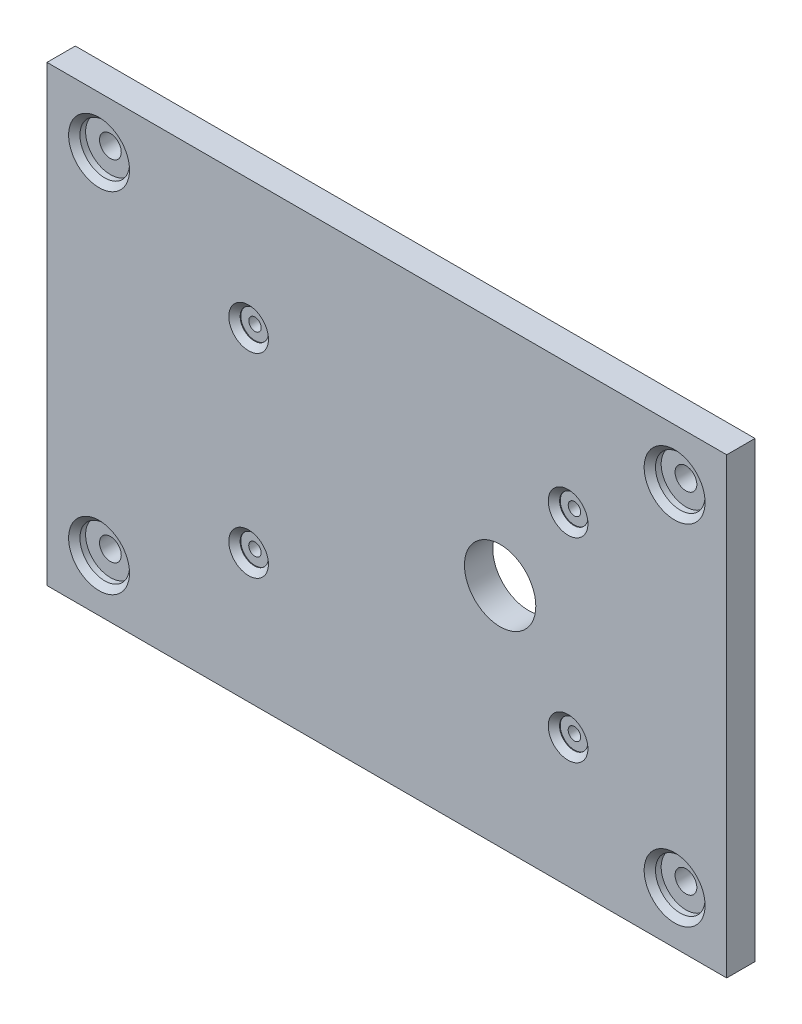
from build123d import *

# Parameters (mm, degrees)
SKETCH1_W                                   = 76.2
SKETCH1_H                                   = 50.8
BOSS_EXTRUDE1_DEPTH                         = 3.175
CBORE_FOR_2_BINDING_HEAD_MACHINE_SC_2_COUNT = 2
CBORE_FOR_2_BINDING_HEAD_MACHINE_SC_2_PITCH = 75.461112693
CBORE_FOR_2_BINDING_HEAD_MACHINE_SC_3_COUNT = 2
CBORE_FOR_2_BINDING_HEAD_MACHINE_SC_3_PITCH = 39.125667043
CBORE_FOR_2_BINDING_HEAD_MACHINE_SC_4_COUNT = 2
CBORE_FOR_2_BINDING_HEAD_MACHINE_SC_4_PITCH = 64.525667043
SKETCH4_R                                   = 4.0005
CUT_EXTRUDE1_DEPTH                          = 92.636022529
CBORE_FOR_00_BINDING_HEAD_MACHINE_S_2_COUNT = 2
CBORE_FOR_00_BINDING_HEAD_MACHINE_S_2_PITCH = 41.949235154
CBORE_FOR_00_BINDING_HEAD_MACHINE_S_3_COUNT = 2
CBORE_FOR_00_BINDING_HEAD_MACHINE_S_3_PITCH = 35.814618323
CBORE_FOR_00_BINDING_HEAD_MACHINE_S_4_COUNT = 2
CBORE_FOR_00_BINDING_HEAD_MACHINE_S_4_PITCH = 21.844663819


with BuildPart() as part:
    # Sketch1 → Boss-Extrude1 (new body)
    with BuildSketch(Plane.XY):
        with Locations((38.1, 25.4)):
            Rectangle(SKETCH1_W, SKETCH1_H)
    extrude(amount=BOSS_EXTRUDE1_DEPTH)

    # Sketch3 → CBORE for _2 Binding Head Machine Screw1 (revolve, cut)
    with BuildSketch(Plane(origin=(70.362833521, 5.837166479, 3.175), x_dir=(0, -1, 0), z_dir=(1, 0, 0))):
        Polygon((0, 0), (0, 13.432569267), (1.2192, 12.7), (1.2192, 1.27), (2.77876, 1.27), (2.77876, 0.635), (3.41376, 0), align=None)
    cbore_for_2_binding_head_machine_screw1 = revolve(axis=Axis((70.362833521, 5.837166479, 9.525), (0, 0, -1)), mode=Mode.SUBTRACT)

    # CBORE for _2 Binding Head Machine Sc 2: CBORE for _2 Binding Head Machine Screw1 ×2
    with Locations(*[Vector(-0.8550850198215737, 0.5184878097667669, 0) * (i * CBORE_FOR_2_BINDING_HEAD_MACHINE_SC_2_PITCH) for i in range(1, CBORE_FOR_2_BINDING_HEAD_MACHINE_SC_2_COUNT)]):
        add(cbore_for_2_binding_head_machine_screw1, mode=Mode.SUBTRACT)

    # CBORE for _2 Binding Head Machine Sc 3: CBORE for _2 Binding Head Machine Screw1 ×2
    with Locations(*[(0, i * CBORE_FOR_2_BINDING_HEAD_MACHINE_SC_3_PITCH, 0) for i in range(1, CBORE_FOR_2_BINDING_HEAD_MACHINE_SC_3_COUNT)]):
        add(cbore_for_2_binding_head_machine_screw1, mode=Mode.SUBTRACT)

    # CBORE for _2 Binding Head Machine Sc 4: CBORE for _2 Binding Head Machine Screw1 ×2
    with Locations(*[(-i * CBORE_FOR_2_BINDING_HEAD_MACHINE_SC_4_PITCH, 0, 0) for i in range(1, CBORE_FOR_2_BINDING_HEAD_MACHINE_SC_4_COUNT)]):
        add(cbore_for_2_binding_head_machine_screw1, mode=Mode.SUBTRACT)

    # Sketch4 → Cut-Extrude1 (cut, through all)
    with BuildSketch(Plane.XY.offset(3.175)):
        with Locations((50.8, 25.4)):
            Circle(SKETCH4_R)
    extrude(amount=-CUT_EXTRUDE1_DEPTH, mode=Mode.SUBTRACT)

    # Sketch7 → CBORE for _00 Binding Head Machine Screw (revolve, cut)
    with BuildSketch(Plane(origin=(58.417617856, 14.476338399, 3.175), x_dir=(0, -1, 0), z_dir=(1, 0, 0))):
        Polygon((0, 0), (0, 13.119701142), (0.6985, 12.7), (0.6985, 0.7112), (1.5875, 0.7112), (1.5875, 0.635), (2.2225, 0), align=None)
    cbore_for_00_binding_head_machine_screw = revolve(axis=Axis((58.417617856, 14.476338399, 9.525), (0, 0, -1)), mode=Mode.SUBTRACT)

    # CBORE for _00 Binding Head Machine S 2: CBORE for _00 Binding Head Machine Screw ×2
    with Locations(*[Vector(-0.8536700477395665, 0.5208142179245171, 0) * (i * CBORE_FOR_00_BINDING_HEAD_MACHINE_S_2_PITCH) for i in range(1, CBORE_FOR_00_BINDING_HEAD_MACHINE_S_2_COUNT)]):
        add(cbore_for_00_binding_head_machine_screw, mode=Mode.SUBTRACT)

    # CBORE for _00 Binding Head Machine S 3: CBORE for _00 Binding Head Machine Screw ×2
    with Locations(*[Vector(-0.9999999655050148, 0.00026265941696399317, 0) * (i * CBORE_FOR_00_BINDING_HEAD_MACHINE_S_3_PITCH) for i in range(1, CBORE_FOR_00_BINDING_HEAD_MACHINE_S_3_COUNT)]):
        add(cbore_for_00_binding_head_machine_screw, mode=Mode.SUBTRACT)

    # CBORE for _00 Binding Head Machine S 4: CBORE for _00 Binding Head Machine Screw ×2
    with Locations(*[Vector(0.00017453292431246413, 0.9999999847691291, 0) * (i * CBORE_FOR_00_BINDING_HEAD_MACHINE_S_4_PITCH) for i in range(1, CBORE_FOR_00_BINDING_HEAD_MACHINE_S_4_COUNT)]):
        add(cbore_for_00_binding_head_machine_screw, mode=Mode.SUBTRACT)


solid = part.part
